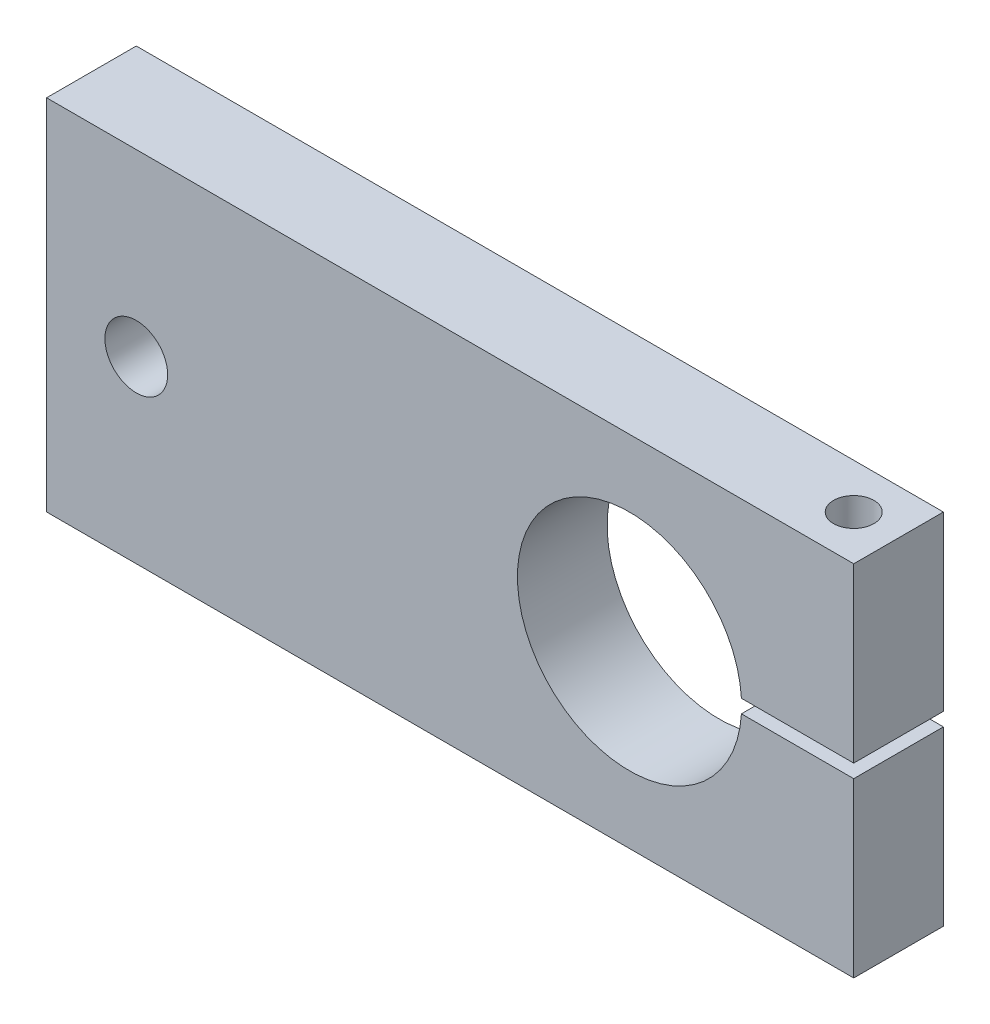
ISO-10303-21;
HEADER;
FILE_DESCRIPTION(('STEP AP214'),'2;1');
FILE_NAME('part.step','',(''),(''),'','','');
FILE_SCHEMA(('AUTOMOTIVE_DESIGN { 1 0 10303 214 1 1 1 1 }'));
ENDSEC;
DATA;
#1=APPLICATION_CONTEXT('core data for automotive mechanical design processes');
#2=APPLICATION_PROTOCOL_DEFINITION('international standard','automotive_design',2000,#1);
#3=PRODUCT_CONTEXT('',#1,'mechanical');
#4=PRODUCT('Part','Part','',(#3));
#5=PRODUCT_RELATED_PRODUCT_CATEGORY('part','',(#4));
#6=PRODUCT_DEFINITION_FORMATION('','',#4);
#7=PRODUCT_DEFINITION_CONTEXT('part definition',#1,'design');
#8=PRODUCT_DEFINITION('design','',#6,#7);
#9=PRODUCT_DEFINITION_SHAPE('','',#8);
#10=(LENGTH_UNIT() NAMED_UNIT(*) SI_UNIT(.MILLI.,.METRE.));
#11=(NAMED_UNIT(*) PLANE_ANGLE_UNIT() SI_UNIT($,.RADIAN.));
#12=(NAMED_UNIT(*) SI_UNIT($,.STERADIAN.) SOLID_ANGLE_UNIT());
#13=UNCERTAINTY_MEASURE_WITH_UNIT(LENGTH_MEASURE(1.E-05),#10,'distance_accuracy_value','');
#14=(GEOMETRIC_REPRESENTATION_CONTEXT(3) GLOBAL_UNCERTAINTY_ASSIGNED_CONTEXT((#13)) GLOBAL_UNIT_ASSIGNED_CONTEXT((#10,
#11,#12)) REPRESENTATION_CONTEXT('',''));
#15=CARTESIAN_POINT('',(0.,0.,0.));
#16=DIRECTION('',(0.,0.,1.));
#17=DIRECTION('',(1.,0.,0.));
#18=AXIS2_PLACEMENT_3D('',#15,#16,#17);
#19=CARTESIAN_POINT('',(0.,0.,20.));
#20=DIRECTION('',(0.,0.,1.));
#21=DIRECTION('',(1.,0.,0.));
#22=AXIS2_PLACEMENT_3D('',#19,#20,#21);
#23=PLANE('',#22);
#24=DIRECTION('',(1.,0.,0.));
#25=VECTOR('',#24,1.);
#26=CARTESIAN_POINT('',(-130.,-40.,20.));
#27=LINE('',#26,#25);
#28=CARTESIAN_POINT('',(-130.,-40.,20.));
#29=VERTEX_POINT('',#28);
#30=CARTESIAN_POINT('',(50.,-40.,20.));
#31=VERTEX_POINT('',#30);
#32=EDGE_CURVE('E147',#29,#31,#27,.T.);
#33=ORIENTED_EDGE('',*,*,#32,.T.);
#34=DIRECTION('',(0.,1.,0.));
#35=VECTOR('',#34,1.);
#36=CARTESIAN_POINT('',(50.,-40.,20.));
#37=LINE('',#36,#35);
#38=CARTESIAN_POINT('',(50.,-1.5,20.));
#39=VERTEX_POINT('',#38);
#40=EDGE_CURVE('E95',#31,#39,#37,.T.);
#41=ORIENTED_EDGE('',*,*,#40,.T.);
#42=DIRECTION('',(-1.,0.,0.));
#43=VECTOR('',#42,1.);
#44=CARTESIAN_POINT('',(24.9549594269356,-1.5,20.));
#45=LINE('',#44,#43);
#46=CARTESIAN_POINT('',(24.9549594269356,-1.5,20.));
#47=VERTEX_POINT('',#46);
#48=EDGE_CURVE('E162',#39,#47,#45,.T.);
#49=ORIENTED_EDGE('',*,*,#48,.T.);
#50=CARTESIAN_POINT('',(0.,0.,20.));
#51=DIRECTION('',(0.,0.,-1.));
#52=DIRECTION('',(1.,0.,0.));
#53=AXIS2_PLACEMENT_3D('',#50,#51,#52);
#54=CIRCLE('',#53,25.);
#55=CARTESIAN_POINT('',(24.9549594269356,1.5,20.));
#56=VERTEX_POINT('',#55);
#57=EDGE_CURVE('E175',#47,#56,#54,.T.);
#58=ORIENTED_EDGE('',*,*,#57,.T.);
#59=DIRECTION('',(1.,0.,0.));
#60=VECTOR('',#59,1.);
#61=CARTESIAN_POINT('',(24.9549594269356,1.5,20.));
#62=LINE('',#61,#60);
#63=CARTESIAN_POINT('',(50.,1.5,20.));
#64=VERTEX_POINT('',#63);
#65=EDGE_CURVE('E114',#56,#64,#62,.T.);
#66=ORIENTED_EDGE('',*,*,#65,.T.);
#67=DIRECTION('',(0.,1.,0.));
#68=VECTOR('',#67,1.);
#69=CARTESIAN_POINT('',(50.,1.5,20.));
#70=LINE('',#69,#68);
#71=CARTESIAN_POINT('',(50.,40.,20.));
#72=VERTEX_POINT('',#71);
#73=EDGE_CURVE('E108',#64,#72,#70,.T.);
#74=ORIENTED_EDGE('',*,*,#73,.T.);
#75=DIRECTION('',(-1.,0.,0.));
#76=VECTOR('',#75,1.);
#77=CARTESIAN_POINT('',(50.,40.,20.));
#78=LINE('',#77,#76);
#79=CARTESIAN_POINT('',(-130.,40.,20.));
#80=VERTEX_POINT('',#79);
#81=EDGE_CURVE('E112',#72,#80,#78,.T.);
#82=ORIENTED_EDGE('',*,*,#81,.T.);
#83=DIRECTION('',(0.,-1.,0.));
#84=VECTOR('',#83,1.);
#85=CARTESIAN_POINT('',(-130.,40.,20.));
#86=LINE('',#85,#84);
#87=EDGE_CURVE('E52',#80,#29,#86,.T.);
#88=ORIENTED_EDGE('',*,*,#87,.T.);
#89=EDGE_LOOP('',(#33,#41,#49,#58,#66,#74,#82,#88));
#90=FACE_BOUND('',#89,.T.);
#91=CARTESIAN_POINT('',(-110.,0.,20.));
#92=DIRECTION('',(0.,0.,1.));
#93=DIRECTION('',(1.,0.,0.));
#94=AXIS2_PLACEMENT_3D('',#91,#92,#93);
#95=CIRCLE('',#94,7.);
#96=CARTESIAN_POINT('',(-103.,0.,20.));
#97=VERTEX_POINT('',#96);
#98=EDGE_CURVE('E136',#97,#97,#95,.T.);
#99=ORIENTED_EDGE('',*,*,#98,.F.);
#100=EDGE_LOOP('',(#99));
#101=FACE_BOUND('',#100,.T.);
#102=ADVANCED_FACE('F35',(#90,#101),#23,.T.);
#103=CARTESIAN_POINT('',(0.,0.,0.));
#104=DIRECTION('',(0.,0.,1.));
#105=DIRECTION('',(1.,0.,0.));
#106=AXIS2_PLACEMENT_3D('',#103,#104,#105);
#107=PLANE('',#106);
#108=DIRECTION('',(1.,0.,0.));
#109=VECTOR('',#108,1.);
#110=CARTESIAN_POINT('',(-130.,-40.,0.));
#111=LINE('',#110,#109);
#112=CARTESIAN_POINT('',(-130.,-40.,0.));
#113=VERTEX_POINT('',#112);
#114=CARTESIAN_POINT('',(50.,-40.,0.));
#115=VERTEX_POINT('',#114);
#116=EDGE_CURVE('E132',#113,#115,#111,.T.);
#117=ORIENTED_EDGE('',*,*,#116,.F.);
#118=DIRECTION('',(0.,-1.,0.));
#119=VECTOR('',#118,1.);
#120=CARTESIAN_POINT('',(-130.,40.,0.));
#121=LINE('',#120,#119);
#122=CARTESIAN_POINT('',(-130.,40.,0.));
#123=VERTEX_POINT('',#122);
#124=EDGE_CURVE('E87',#123,#113,#121,.T.);
#125=ORIENTED_EDGE('',*,*,#124,.F.);
#126=DIRECTION('',(-1.,0.,0.));
#127=VECTOR('',#126,1.);
#128=CARTESIAN_POINT('',(50.,40.,0.));
#129=LINE('',#128,#127);
#130=CARTESIAN_POINT('',(50.,40.,0.));
#131=VERTEX_POINT('',#130);
#132=EDGE_CURVE('E81',#131,#123,#129,.T.);
#133=ORIENTED_EDGE('',*,*,#132,.F.);
#134=DIRECTION('',(0.,1.,0.));
#135=VECTOR('',#134,1.);
#136=CARTESIAN_POINT('',(50.,1.5,0.));
#137=LINE('',#136,#135);
#138=CARTESIAN_POINT('',(50.,1.5,0.));
#139=VERTEX_POINT('',#138);
#140=EDGE_CURVE('E122',#139,#131,#137,.T.);
#141=ORIENTED_EDGE('',*,*,#140,.F.);
#142=DIRECTION('',(1.,0.,0.));
#143=VECTOR('',#142,1.);
#144=CARTESIAN_POINT('',(24.9549594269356,1.5,0.));
#145=LINE('',#144,#143);
#146=CARTESIAN_POINT('',(24.9549594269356,1.5,0.));
#147=VERTEX_POINT('',#146);
#148=EDGE_CURVE('E142',#147,#139,#145,.T.);
#149=ORIENTED_EDGE('',*,*,#148,.F.);
#150=CARTESIAN_POINT('',(0.,0.,0.));
#151=DIRECTION('',(0.,0.,-1.));
#152=DIRECTION('',(1.,0.,0.));
#153=AXIS2_PLACEMENT_3D('',#150,#151,#152);
#154=CIRCLE('',#153,25.);
#155=CARTESIAN_POINT('',(24.9549594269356,-1.5,0.));
#156=VERTEX_POINT('',#155);
#157=EDGE_CURVE('E140',#156,#147,#154,.T.);
#158=ORIENTED_EDGE('',*,*,#157,.F.);
#159=DIRECTION('',(-1.,0.,0.));
#160=VECTOR('',#159,1.);
#161=CARTESIAN_POINT('',(24.9549594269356,-1.5,0.));
#162=LINE('',#161,#160);
#163=CARTESIAN_POINT('',(50.,-1.5,0.));
#164=VERTEX_POINT('',#163);
#165=EDGE_CURVE('E138',#164,#156,#162,.T.);
#166=ORIENTED_EDGE('',*,*,#165,.F.);
#167=DIRECTION('',(0.,1.,0.));
#168=VECTOR('',#167,1.);
#169=CARTESIAN_POINT('',(50.,-40.,0.));
#170=LINE('',#169,#168);
#171=EDGE_CURVE('E135',#115,#164,#170,.T.);
#172=ORIENTED_EDGE('',*,*,#171,.F.);
#173=EDGE_LOOP('',(#117,#125,#133,#141,#149,#158,#166,#172));
#174=FACE_BOUND('',#173,.T.);
#175=CARTESIAN_POINT('',(-110.,0.,0.));
#176=DIRECTION('',(0.,0.,1.));
#177=DIRECTION('',(1.,0.,0.));
#178=AXIS2_PLACEMENT_3D('',#175,#176,#177);
#179=CIRCLE('',#178,7.);
#180=CARTESIAN_POINT('',(-103.,0.,0.));
#181=VERTEX_POINT('',#180);
#182=EDGE_CURVE('E181',#181,#181,#179,.T.);
#183=ORIENTED_EDGE('',*,*,#182,.T.);
#184=EDGE_LOOP('',(#183));
#185=FACE_BOUND('',#184,.T.);
#186=ADVANCED_FACE('F166',(#174,#185),#107,.F.);
#187=CARTESIAN_POINT('',(-130.,-40.,20.));
#188=DIRECTION('',(0.,1.,0.));
#189=DIRECTION('',(0.,0.,1.));
#190=AXIS2_PLACEMENT_3D('',#187,#188,#189);
#191=PLANE('',#190);
#192=CARTESIAN_POINT('',(40.,-40.,10.));
#193=DIRECTION('',(0.,-1.,0.));
#194=DIRECTION('',(0.,0.,-1.));
#195=AXIS2_PLACEMENT_3D('',#192,#193,#194);
#196=CIRCLE('',#195,7.);
#197=CARTESIAN_POINT('',(40.,-40.,3.));
#198=VERTEX_POINT('',#197);
#199=EDGE_CURVE('E187',#198,#198,#196,.T.);
#200=ORIENTED_EDGE('',*,*,#199,.F.);
#201=EDGE_LOOP('',(#200));
#202=FACE_BOUND('',#201,.T.);
#203=ORIENTED_EDGE('',*,*,#116,.T.);
#204=DIRECTION('',(0.,0.,-1.));
#205=VECTOR('',#204,1.);
#206=CARTESIAN_POINT('',(50.,-40.,20.));
#207=LINE('',#206,#205);
#208=EDGE_CURVE('E11',#31,#115,#207,.T.);
#209=ORIENTED_EDGE('',*,*,#208,.F.);
#210=ORIENTED_EDGE('',*,*,#32,.F.);
#211=DIRECTION('',(0.,0.,-1.));
#212=VECTOR('',#211,1.);
#213=CARTESIAN_POINT('',(-130.,-40.,20.));
#214=LINE('',#213,#212);
#215=EDGE_CURVE('E128',#29,#113,#214,.T.);
#216=ORIENTED_EDGE('',*,*,#215,.T.);
#217=EDGE_LOOP('',(#203,#209,#210,#216));
#218=FACE_BOUND('',#217,.T.);
#219=ADVANCED_FACE('F37',(#202,#218),#191,.F.);
#220=CARTESIAN_POINT('',(50.,-40.,20.));
#221=DIRECTION('',(-1.,0.,0.));
#222=DIRECTION('',(0.,0.,1.));
#223=AXIS2_PLACEMENT_3D('',#220,#221,#222);
#224=PLANE('',#223);
#225=ORIENTED_EDGE('',*,*,#171,.T.);
#226=DIRECTION('',(0.,0.,-1.));
#227=VECTOR('',#226,1.);
#228=CARTESIAN_POINT('',(50.,-1.5,20.));
#229=LINE('',#228,#227);
#230=EDGE_CURVE('E44',#39,#164,#229,.T.);
#231=ORIENTED_EDGE('',*,*,#230,.F.);
#232=ORIENTED_EDGE('',*,*,#40,.F.);
#233=ORIENTED_EDGE('',*,*,#208,.T.);
#234=EDGE_LOOP('',(#225,#231,#232,#233));
#235=FACE_BOUND('',#234,.T.);
#236=ADVANCED_FACE('F223',(#235),#224,.F.);
#237=CARTESIAN_POINT('',(24.9549594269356,-1.5,20.));
#238=DIRECTION('',(0.,-1.,0.));
#239=DIRECTION('',(1.,0.,0.));
#240=AXIS2_PLACEMENT_3D('',#237,#238,#239);
#241=PLANE('',#240);
#242=CARTESIAN_POINT('',(40.,-1.5,10.));
#243=DIRECTION('',(0.,-1.,0.));
#244=DIRECTION('',(1.,0.,0.));
#245=AXIS2_PLACEMENT_3D('',#242,#243,#244);
#246=CIRCLE('',#245,4.5);
#247=CARTESIAN_POINT('',(44.5,-1.5,10.));
#248=VERTEX_POINT('',#247);
#249=EDGE_CURVE('E190',#248,#248,#246,.T.);
#250=ORIENTED_EDGE('',*,*,#249,.T.);
#251=EDGE_LOOP('',(#250));
#252=FACE_BOUND('',#251,.T.);
#253=ORIENTED_EDGE('',*,*,#165,.T.);
#254=DIRECTION('',(0.,0.,-1.));
#255=VECTOR('',#254,1.);
#256=CARTESIAN_POINT('',(24.9549594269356,-1.5,20.));
#257=LINE('',#256,#255);
#258=EDGE_CURVE('E154',#47,#156,#257,.T.);
#259=ORIENTED_EDGE('',*,*,#258,.F.);
#260=ORIENTED_EDGE('',*,*,#48,.F.);
#261=ORIENTED_EDGE('',*,*,#230,.T.);
#262=EDGE_LOOP('',(#253,#259,#260,#261));
#263=FACE_BOUND('',#262,.T.);
#264=ADVANCED_FACE('F160',(#252,#263),#241,.F.);
#265=CARTESIAN_POINT('',(0.,0.,20.));
#266=DIRECTION('',(0.,0.,-1.));
#267=DIRECTION('',(-1.,0.,0.));
#268=AXIS2_PLACEMENT_3D('',#265,#266,#267);
#269=CYLINDRICAL_SURFACE('',#268,25.);
#270=ORIENTED_EDGE('',*,*,#157,.T.);
#271=DIRECTION('',(0.,0.,-1.));
#272=VECTOR('',#271,1.);
#273=CARTESIAN_POINT('',(24.9549594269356,1.5,20.));
#274=LINE('',#273,#272);
#275=EDGE_CURVE('E151',#56,#147,#274,.T.);
#276=ORIENTED_EDGE('',*,*,#275,.F.);
#277=ORIENTED_EDGE('',*,*,#57,.F.);
#278=ORIENTED_EDGE('',*,*,#258,.T.);
#279=EDGE_LOOP('',(#270,#276,#277,#278));
#280=FACE_BOUND('',#279,.T.);
#281=ADVANCED_FACE('F171',(#280),#269,.F.);
#282=CARTESIAN_POINT('',(24.9549594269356,1.5,20.));
#283=DIRECTION('',(0.,1.,0.));
#284=DIRECTION('',(0.,0.,1.));
#285=AXIS2_PLACEMENT_3D('',#282,#283,#284);
#286=PLANE('',#285);
#287=CARTESIAN_POINT('',(40.,1.5,10.));
#288=DIRECTION('',(0.,1.,0.));
#289=DIRECTION('',(0.,0.,1.));
#290=AXIS2_PLACEMENT_3D('',#287,#288,#289);
#291=CIRCLE('',#290,4.5);
#292=CARTESIAN_POINT('',(40.,1.5,14.5));
#293=VERTEX_POINT('',#292);
#294=EDGE_CURVE('E195',#293,#293,#291,.T.);
#295=ORIENTED_EDGE('',*,*,#294,.T.);
#296=EDGE_LOOP('',(#295));
#297=FACE_BOUND('',#296,.T.);
#298=ORIENTED_EDGE('',*,*,#148,.T.);
#299=DIRECTION('',(0.,0.,-1.));
#300=VECTOR('',#299,1.);
#301=CARTESIAN_POINT('',(50.,1.5,20.));
#302=LINE('',#301,#300);
#303=EDGE_CURVE('E123',#64,#139,#302,.T.);
#304=ORIENTED_EDGE('',*,*,#303,.F.);
#305=ORIENTED_EDGE('',*,*,#65,.F.);
#306=ORIENTED_EDGE('',*,*,#275,.T.);
#307=EDGE_LOOP('',(#298,#304,#305,#306));
#308=FACE_BOUND('',#307,.T.);
#309=ADVANCED_FACE('F174',(#297,#308),#286,.F.);
#310=CARTESIAN_POINT('',(50.,1.5,20.));
#311=DIRECTION('',(-1.,0.,0.));
#312=DIRECTION('',(0.,0.,1.));
#313=AXIS2_PLACEMENT_3D('',#310,#311,#312);
#314=PLANE('',#313);
#315=ORIENTED_EDGE('',*,*,#140,.T.);
#316=DIRECTION('',(0.,0.,-1.));
#317=VECTOR('',#316,1.);
#318=CARTESIAN_POINT('',(50.,40.,20.));
#319=LINE('',#318,#317);
#320=EDGE_CURVE('E119',#72,#131,#319,.T.);
#321=ORIENTED_EDGE('',*,*,#320,.F.);
#322=ORIENTED_EDGE('',*,*,#73,.F.);
#323=ORIENTED_EDGE('',*,*,#303,.T.);
#324=EDGE_LOOP('',(#315,#321,#322,#323));
#325=FACE_BOUND('',#324,.T.);
#326=ADVANCED_FACE('F120',(#325),#314,.F.);
#327=CARTESIAN_POINT('',(50.,40.,20.));
#328=DIRECTION('',(0.,-1.,0.));
#329=DIRECTION('',(1.,0.,0.));
#330=AXIS2_PLACEMENT_3D('',#327,#328,#329);
#331=PLANE('',#330);
#332=CARTESIAN_POINT('',(40.,40.,10.));
#333=DIRECTION('',(0.,-1.,0.));
#334=DIRECTION('',(1.,0.,0.));
#335=AXIS2_PLACEMENT_3D('',#332,#333,#334);
#336=CIRCLE('',#335,4.5);
#337=CARTESIAN_POINT('',(44.5,40.,10.));
#338=VERTEX_POINT('',#337);
#339=EDGE_CURVE('E198',#338,#338,#336,.T.);
#340=ORIENTED_EDGE('',*,*,#339,.T.);
#341=EDGE_LOOP('',(#340));
#342=FACE_BOUND('',#341,.T.);
#343=ORIENTED_EDGE('',*,*,#132,.T.);
#344=DIRECTION('',(0.,0.,-1.));
#345=VECTOR('',#344,1.);
#346=CARTESIAN_POINT('',(-130.,40.,20.));
#347=LINE('',#346,#345);
#348=EDGE_CURVE('E124',#80,#123,#347,.T.);
#349=ORIENTED_EDGE('',*,*,#348,.F.);
#350=ORIENTED_EDGE('',*,*,#81,.F.);
#351=ORIENTED_EDGE('',*,*,#320,.T.);
#352=EDGE_LOOP('',(#343,#349,#350,#351));
#353=FACE_BOUND('',#352,.T.);
#354=ADVANCED_FACE('F126',(#342,#353),#331,.F.);
#355=CARTESIAN_POINT('',(-130.,40.,20.));
#356=DIRECTION('',(1.,0.,0.));
#357=DIRECTION('',(0.,1.,0.));
#358=AXIS2_PLACEMENT_3D('',#355,#356,#357);
#359=PLANE('',#358);
#360=ORIENTED_EDGE('',*,*,#124,.T.);
#361=ORIENTED_EDGE('',*,*,#215,.F.);
#362=ORIENTED_EDGE('',*,*,#87,.F.);
#363=ORIENTED_EDGE('',*,*,#348,.T.);
#364=EDGE_LOOP('',(#360,#361,#362,#363));
#365=FACE_BOUND('',#364,.T.);
#366=ADVANCED_FACE('F226',(#365),#359,.F.);
#367=CARTESIAN_POINT('',(-110.,0.,20.));
#368=DIRECTION('',(0.,0.,-1.));
#369=DIRECTION('',(-1.,0.,0.));
#370=AXIS2_PLACEMENT_3D('',#367,#368,#369);
#371=CYLINDRICAL_SURFACE('',#370,7.);
#372=ORIENTED_EDGE('',*,*,#98,.T.);
#373=EDGE_LOOP('',(#372));
#374=FACE_BOUND('',#373,.T.);
#375=ORIENTED_EDGE('',*,*,#182,.F.);
#376=EDGE_LOOP('',(#375));
#377=FACE_BOUND('',#376,.T.);
#378=ADVANCED_FACE('F217',(#374,#377),#371,.F.);
#379=CARTESIAN_POINT('',(40.,-30.,10.));
#380=DIRECTION('',(0.,-1.,0.));
#381=DIRECTION('',(0.,0.,-1.));
#382=AXIS2_PLACEMENT_3D('',#379,#380,#381);
#383=CYLINDRICAL_SURFACE('',#382,7.);
#384=CARTESIAN_POINT('',(40.,-30.,10.));
#385=DIRECTION('',(0.,-1.,0.));
#386=DIRECTION('',(0.,0.,-1.));
#387=AXIS2_PLACEMENT_3D('',#384,#385,#386);
#388=CIRCLE('',#387,7.);
#389=CARTESIAN_POINT('',(40.,-30.,3.));
#390=VERTEX_POINT('',#389);
#391=EDGE_CURVE('E184',#390,#390,#388,.T.);
#392=ORIENTED_EDGE('',*,*,#391,.F.);
#393=EDGE_LOOP('',(#392));
#394=FACE_BOUND('',#393,.T.);
#395=ORIENTED_EDGE('',*,*,#199,.T.);
#396=EDGE_LOOP('',(#395));
#397=FACE_BOUND('',#396,.T.);
#398=ADVANCED_FACE('F211',(#394,#397),#383,.F.);
#399=CARTESIAN_POINT('',(40.,-30.,10.));
#400=DIRECTION('',(0.,-1.,0.));
#401=DIRECTION('',(0.,0.,-1.));
#402=AXIS2_PLACEMENT_3D('',#399,#400,#401);
#403=PLANE('',#402);
#404=CARTESIAN_POINT('',(40.,-30.,10.));
#405=DIRECTION('',(0.,-1.,0.));
#406=DIRECTION('',(0.,0.,-1.));
#407=AXIS2_PLACEMENT_3D('',#404,#405,#406);
#408=CIRCLE('',#407,4.5);
#409=CARTESIAN_POINT('',(40.,-30.,5.5));
#410=VERTEX_POINT('',#409);
#411=EDGE_CURVE('E201',#410,#410,#408,.T.);
#412=ORIENTED_EDGE('',*,*,#411,.F.);
#413=EDGE_LOOP('',(#412));
#414=FACE_BOUND('',#413,.T.);
#415=ORIENTED_EDGE('',*,*,#391,.T.);
#416=EDGE_LOOP('',(#415));
#417=FACE_BOUND('',#416,.T.);
#418=ADVANCED_FACE('F208',(#414,#417),#403,.T.);
#419=CARTESIAN_POINT('',(40.,48.,10.));
#420=DIRECTION('',(0.,-1.,0.));
#421=DIRECTION('',(0.,0.,-1.));
#422=AXIS2_PLACEMENT_3D('',#419,#420,#421);
#423=CYLINDRICAL_SURFACE('',#422,4.5);
#424=ORIENTED_EDGE('',*,*,#411,.T.);
#425=EDGE_LOOP('',(#424));
#426=FACE_BOUND('',#425,.T.);
#427=ORIENTED_EDGE('',*,*,#249,.F.);
#428=EDGE_LOOP('',(#427));
#429=FACE_BOUND('',#428,.T.);
#430=ADVANCED_FACE('F205',(#426,#429),#423,.F.);
#431=ORIENTED_EDGE('',*,*,#339,.F.);
#432=EDGE_LOOP('',(#431));
#433=FACE_BOUND('',#432,.T.);
#434=ORIENTED_EDGE('',*,*,#294,.F.);
#435=EDGE_LOOP('',(#434));
#436=FACE_BOUND('',#435,.T.);
#437=ADVANCED_FACE('F246',(#433,#436),#423,.F.);
#438=CLOSED_SHELL('',(#102,#186,#219,#236,#264,#281,#309,#326,#354,#366,#378,#398,#418,#430,#437));
#439=MANIFOLD_SOLID_BREP('B2',#438);
#440=ADVANCED_BREP_SHAPE_REPRESENTATION('',(#18,#439),#14);
#441=SHAPE_DEFINITION_REPRESENTATION(#9,#440);
ENDSEC;
END-ISO-10303-21;
